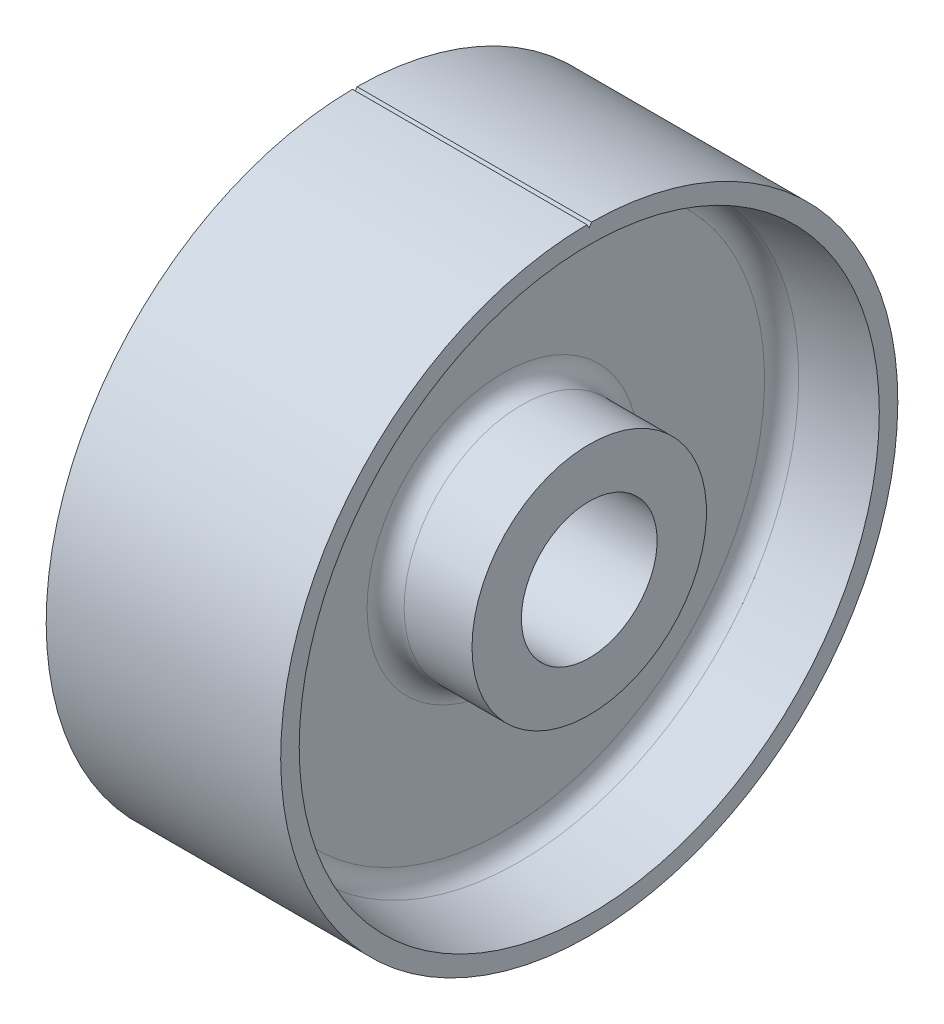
from build123d import *

# Parameters (mm, degrees)
FILLET_1_R          = 3
CUT_EXTRUDE_1_DEPTH = 81.274528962


with BuildPart() as part:
    # Sketch 1 → Revolve 1 (revolve)
    with BuildSketch(Plane.XY, mode=Mode.PRIVATE) as revolve_1_sk:
        Polygon((-19, 11), (19, 11), (19, 19), (5, 19), (5, 45), (19, 47), (19, 50), (-19, 50), (-19, 47), (-5, 45), (-5, 19), (-19, 19), align=None)
    revolve(revolve_1_sk.sketch.rotate(Axis((-30.665853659, 0, 0), (1, 0, 0)), 90), axis=Axis((-30.665853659, 0, 0), (1, 0, 0)))

    # Fillet 1
    fillet_1_edges = [part.edges().sort_by_distance(p)[0] for p in [
        (-5, 0, -19),
        (5, 0, -19),
        (5, 0, -45),
        (-5, 0, -45),
    ]]
    fillet(fillet_1_edges, radius=FILLET_1_R)

    # Sketch 2 → Cut-Extrude 1 (cut, through all)
    with BuildSketch(Plane(origin=(19, 0, 0), x_dir=(0, 0, -1), z_dir=(1, 0, 0))):
        Polygon((-0.913442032, 50.94560231), (0.913442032, 50.94560231), (0, 49.363474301), align=None)
    extrude(amount=-CUT_EXTRUDE_1_DEPTH, mode=Mode.SUBTRACT)


solid = part.part
